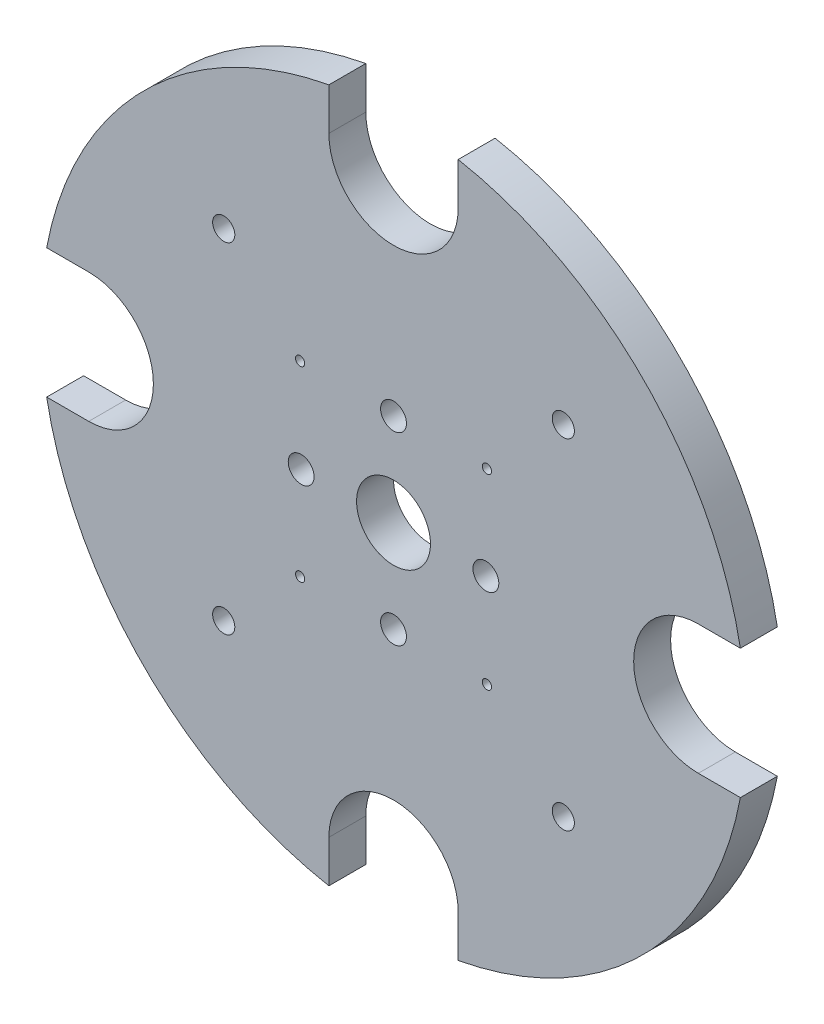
ISO-10303-21;
HEADER;
FILE_DESCRIPTION(('STEP AP214'),'2;1');
FILE_NAME('part.step','',(''),(''),'','','');
FILE_SCHEMA(('AUTOMOTIVE_DESIGN { 1 0 10303 214 1 1 1 1 }'));
ENDSEC;
DATA;
#1=APPLICATION_CONTEXT('core data for automotive mechanical design processes');
#2=APPLICATION_PROTOCOL_DEFINITION('international standard','automotive_design',2000,#1);
#3=PRODUCT_CONTEXT('',#1,'mechanical');
#4=PRODUCT('Part','Part','',(#3));
#5=PRODUCT_RELATED_PRODUCT_CATEGORY('part','',(#4));
#6=PRODUCT_DEFINITION_FORMATION('','',#4);
#7=PRODUCT_DEFINITION_CONTEXT('part definition',#1,'design');
#8=PRODUCT_DEFINITION('design','',#6,#7);
#9=PRODUCT_DEFINITION_SHAPE('','',#8);
#10=(LENGTH_UNIT() NAMED_UNIT(*) SI_UNIT(.MILLI.,.METRE.));
#11=(NAMED_UNIT(*) PLANE_ANGLE_UNIT() SI_UNIT($,.RADIAN.));
#12=(NAMED_UNIT(*) SI_UNIT($,.STERADIAN.) SOLID_ANGLE_UNIT());
#13=UNCERTAINTY_MEASURE_WITH_UNIT(LENGTH_MEASURE(1.E-05),#10,'distance_accuracy_value','');
#14=(GEOMETRIC_REPRESENTATION_CONTEXT(3) GLOBAL_UNCERTAINTY_ASSIGNED_CONTEXT((#13)) GLOBAL_UNIT_ASSIGNED_CONTEXT((#10,
#11,#12)) REPRESENTATION_CONTEXT('',''));
#15=CARTESIAN_POINT('',(0.,0.,0.));
#16=DIRECTION('',(0.,0.,1.));
#17=DIRECTION('',(1.,0.,0.));
#18=AXIS2_PLACEMENT_3D('',#15,#16,#17);
#19=CARTESIAN_POINT('',(0.,0.,20.));
#20=DIRECTION('',(0.,0.,-1.));
#21=DIRECTION('',(-1.,0.,0.));
#22=AXIS2_PLACEMENT_3D('',#19,#20,#21);
#23=CYLINDRICAL_SURFACE('',#22,191.);
#24=CARTESIAN_POINT('',(0.,0.,0.));
#25=DIRECTION('',(0.,0.,1.));
#26=DIRECTION('',(1.,0.,0.));
#27=AXIS2_PLACEMENT_3D('',#24,#25,#26);
#28=CIRCLE('',#27,191.);
#29=CARTESIAN_POINT('',(-35.,187.765811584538,0.));
#30=VERTEX_POINT('',#29);
#31=CARTESIAN_POINT('',(-187.765811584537,35.000000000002,0.));
#32=VERTEX_POINT('',#31);
#33=EDGE_CURVE('E344',#30,#32,#28,.T.);
#34=ORIENTED_EDGE('',*,*,#33,.T.);
#35=DIRECTION('',(0.,0.,1.));
#36=VECTOR('',#35,1.);
#37=CARTESIAN_POINT('',(-187.765811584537,35.000000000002,0.));
#38=LINE('',#37,#36);
#39=CARTESIAN_POINT('',(-187.765811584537,35.000000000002,20.0000000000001));
#40=VERTEX_POINT('',#39);
#41=EDGE_CURVE('E182',#32,#40,#38,.T.);
#42=ORIENTED_EDGE('',*,*,#41,.T.);
#43=CARTESIAN_POINT('',(0.,0.,20.));
#44=DIRECTION('',(0.,0.,1.));
#45=DIRECTION('',(1.,0.,0.));
#46=AXIS2_PLACEMENT_3D('',#43,#44,#45);
#47=CIRCLE('',#46,191.);
#48=CARTESIAN_POINT('',(-35.,187.765811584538,20.));
#49=VERTEX_POINT('',#48);
#50=EDGE_CURVE('E11',#49,#40,#47,.T.);
#51=ORIENTED_EDGE('',*,*,#50,.F.);
#52=DIRECTION('',(0.,0.,1.));
#53=VECTOR('',#52,1.);
#54=CARTESIAN_POINT('',(-35.,187.765811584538,0.));
#55=LINE('',#54,#53);
#56=EDGE_CURVE('E257',#30,#49,#55,.T.);
#57=ORIENTED_EDGE('',*,*,#56,.F.);
#58=EDGE_LOOP('',(#34,#42,#51,#57));
#59=FACE_BOUND('',#58,.T.);
#60=ADVANCED_FACE('F38',(#59),#23,.T.);
#61=CARTESIAN_POINT('',(-187.765811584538,-34.999999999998,20.));
#62=VERTEX_POINT('',#61);
#63=CARTESIAN_POINT('',(-35.0000000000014,-187.765811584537,20.0000000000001));
#64=VERTEX_POINT('',#63);
#65=EDGE_CURVE('E46',#62,#64,#47,.T.);
#66=ORIENTED_EDGE('',*,*,#65,.F.);
#67=DIRECTION('',(0.,0.,1.));
#68=VECTOR('',#67,1.);
#69=CARTESIAN_POINT('',(-187.765811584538,-34.999999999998,0.));
#70=LINE('',#69,#68);
#71=CARTESIAN_POINT('',(-187.765811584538,-34.999999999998,0.));
#72=VERTEX_POINT('',#71);
#73=EDGE_CURVE('E158',#72,#62,#70,.T.);
#74=ORIENTED_EDGE('',*,*,#73,.F.);
#75=CARTESIAN_POINT('',(-35.0000000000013,-187.765811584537,0.));
#76=VERTEX_POINT('',#75);
#77=EDGE_CURVE('E346',#72,#76,#28,.T.);
#78=ORIENTED_EDGE('',*,*,#77,.T.);
#79=DIRECTION('',(0.,0.,1.));
#80=VECTOR('',#79,1.);
#81=CARTESIAN_POINT('',(-35.0000000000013,-187.765811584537,0.));
#82=LINE('',#81,#80);
#83=EDGE_CURVE('E206',#76,#64,#82,.T.);
#84=ORIENTED_EDGE('',*,*,#83,.T.);
#85=EDGE_LOOP('',(#66,#74,#78,#84));
#86=FACE_BOUND('',#85,.T.);
#87=ADVANCED_FACE('F393',(#86),#23,.T.);
#88=CARTESIAN_POINT('',(34.9999999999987,-187.765811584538,20.));
#89=VERTEX_POINT('',#88);
#90=CARTESIAN_POINT('',(187.765811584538,-35.0000000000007,20.));
#91=VERTEX_POINT('',#90);
#92=EDGE_CURVE('E350',#89,#91,#47,.T.);
#93=ORIENTED_EDGE('',*,*,#92,.F.);
#94=DIRECTION('',(0.,0.,1.));
#95=VECTOR('',#94,1.);
#96=CARTESIAN_POINT('',(34.9999999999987,-187.765811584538,0.));
#97=LINE('',#96,#95);
#98=CARTESIAN_POINT('',(34.9999999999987,-187.765811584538,0.));
#99=VERTEX_POINT('',#98);
#100=EDGE_CURVE('E195',#99,#89,#97,.T.);
#101=ORIENTED_EDGE('',*,*,#100,.F.);
#102=CARTESIAN_POINT('',(187.765811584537,-35.0000000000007,0.));
#103=VERTEX_POINT('',#102);
#104=EDGE_CURVE('E351',#99,#103,#28,.T.);
#105=ORIENTED_EDGE('',*,*,#104,.T.);
#106=DIRECTION('',(0.,0.,1.));
#107=VECTOR('',#106,1.);
#108=CARTESIAN_POINT('',(187.765811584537,-35.0000000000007,0.));
#109=LINE('',#108,#107);
#110=EDGE_CURVE('E233',#103,#91,#109,.T.);
#111=ORIENTED_EDGE('',*,*,#110,.T.);
#112=EDGE_LOOP('',(#93,#101,#105,#111));
#113=FACE_BOUND('',#112,.T.);
#114=ADVANCED_FACE('F361',(#113),#23,.T.);
#115=CARTESIAN_POINT('',(187.765811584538,34.9999999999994,20.));
#116=VERTEX_POINT('',#115);
#117=CARTESIAN_POINT('',(35.,187.765811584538,19.9999999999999));
#118=VERTEX_POINT('',#117);
#119=EDGE_CURVE('E47',#116,#118,#47,.T.);
#120=ORIENTED_EDGE('',*,*,#119,.F.);
#121=DIRECTION('',(0.,0.,1.));
#122=VECTOR('',#121,1.);
#123=CARTESIAN_POINT('',(187.765811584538,34.9999999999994,0.));
#124=LINE('',#123,#122);
#125=CARTESIAN_POINT('',(187.765811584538,34.9999999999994,0.));
#126=VERTEX_POINT('',#125);
#127=EDGE_CURVE('E220',#126,#116,#124,.T.);
#128=ORIENTED_EDGE('',*,*,#127,.F.);
#129=CARTESIAN_POINT('',(35.,187.765811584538,0.));
#130=VERTEX_POINT('',#129);
#131=EDGE_CURVE('E343',#126,#130,#28,.T.);
#132=ORIENTED_EDGE('',*,*,#131,.T.);
#133=DIRECTION('',(0.,0.,1.));
#134=VECTOR('',#133,1.);
#135=CARTESIAN_POINT('',(35.,187.765811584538,0.));
#136=LINE('',#135,#134);
#137=EDGE_CURVE('E258',#130,#118,#136,.T.);
#138=ORIENTED_EDGE('',*,*,#137,.T.);
#139=EDGE_LOOP('',(#120,#128,#132,#138));
#140=FACE_BOUND('',#139,.T.);
#141=ADVANCED_FACE('F40',(#140),#23,.T.);
#142=CARTESIAN_POINT('',(0.,0.,20.));
#143=DIRECTION('',(0.,0.,1.));
#144=DIRECTION('',(1.,0.,0.));
#145=AXIS2_PLACEMENT_3D('',#142,#143,#144);
#146=PLANE('',#145);
#147=DIRECTION('',(-1.,0.,0.));
#148=VECTOR('',#147,1.);
#149=CARTESIAN_POINT('',(-165.,35.0000000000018,20.));
#150=LINE('',#149,#148);
#151=CARTESIAN_POINT('',(-165.,35.0000000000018,20.));
#152=VERTEX_POINT('',#151);
#153=EDGE_CURVE('E172',#152,#40,#150,.T.);
#154=ORIENTED_EDGE('',*,*,#153,.F.);
#155=CARTESIAN_POINT('',(-165.,1.74860126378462E-12,20.));
#156=DIRECTION('',(0.,0.,1.));
#157=DIRECTION('',(0.,1.,0.));
#158=AXIS2_PLACEMENT_3D('',#155,#156,#157);
#159=CIRCLE('',#158,35.);
#160=CARTESIAN_POINT('',(-165.,-34.9999999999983,20.));
#161=VERTEX_POINT('',#160);
#162=EDGE_CURVE('E165',#161,#152,#159,.T.);
#163=ORIENTED_EDGE('',*,*,#162,.F.);
#164=DIRECTION('',(1.,0.,0.));
#165=VECTOR('',#164,1.);
#166=CARTESIAN_POINT('',(-187.765811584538,-34.999999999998,20.));
#167=LINE('',#166,#165);
#168=EDGE_CURVE('E153',#62,#161,#167,.T.);
#169=ORIENTED_EDGE('',*,*,#168,.F.);
#170=ORIENTED_EDGE('',*,*,#65,.T.);
#171=DIRECTION('',(0.,-1.,0.));
#172=VECTOR('',#171,1.);
#173=CARTESIAN_POINT('',(-35.0000000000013,-165.,20.));
#174=LINE('',#173,#172);
#175=CARTESIAN_POINT('',(-35.0000000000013,-165.,20.));
#176=VERTEX_POINT('',#175);
#177=EDGE_CURVE('E203',#176,#64,#174,.T.);
#178=ORIENTED_EDGE('',*,*,#177,.F.);
#179=CARTESIAN_POINT('',(-1.16573417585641E-12,-165.,20.));
#180=DIRECTION('',(0.,0.,1.));
#181=DIRECTION('',(-1.,0.,0.));
#182=AXIS2_PLACEMENT_3D('',#179,#180,#181);
#183=CIRCLE('',#182,35.);
#184=CARTESIAN_POINT('',(34.9999999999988,-165.,20.));
#185=VERTEX_POINT('',#184);
#186=EDGE_CURVE('E197',#185,#176,#183,.T.);
#187=ORIENTED_EDGE('',*,*,#186,.F.);
#188=DIRECTION('',(0.,1.,0.));
#189=VECTOR('',#188,1.);
#190=CARTESIAN_POINT('',(34.9999999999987,-187.765811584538,20.));
#191=LINE('',#190,#189);
#192=EDGE_CURVE('E188',#89,#185,#191,.T.);
#193=ORIENTED_EDGE('',*,*,#192,.F.);
#194=ORIENTED_EDGE('',*,*,#92,.T.);
#195=DIRECTION('',(1.,0.,0.));
#196=VECTOR('',#195,1.);
#197=CARTESIAN_POINT('',(165.,-35.0000000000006,20.));
#198=LINE('',#197,#196);
#199=CARTESIAN_POINT('',(165.,-35.0000000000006,20.));
#200=VERTEX_POINT('',#199);
#201=EDGE_CURVE('E230',#200,#91,#198,.T.);
#202=ORIENTED_EDGE('',*,*,#201,.F.);
#203=CARTESIAN_POINT('',(165.,-5.55111512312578E-13,20.));
#204=DIRECTION('',(0.,0.,1.));
#205=DIRECTION('',(0.,-1.,0.));
#206=AXIS2_PLACEMENT_3D('',#203,#204,#205);
#207=CIRCLE('',#206,35.);
#208=CARTESIAN_POINT('',(165.,34.9999999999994,20.));
#209=VERTEX_POINT('',#208);
#210=EDGE_CURVE('E222',#209,#200,#207,.T.);
#211=ORIENTED_EDGE('',*,*,#210,.F.);
#212=DIRECTION('',(-1.,0.,0.));
#213=VECTOR('',#212,1.);
#214=CARTESIAN_POINT('',(187.765811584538,34.9999999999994,20.));
#215=LINE('',#214,#213);
#216=EDGE_CURVE('E212',#116,#209,#215,.T.);
#217=ORIENTED_EDGE('',*,*,#216,.F.);
#218=ORIENTED_EDGE('',*,*,#119,.T.);
#219=DIRECTION('',(0.,1.,0.));
#220=VECTOR('',#219,1.);
#221=CARTESIAN_POINT('',(35.,165.,20.));
#222=LINE('',#221,#220);
#223=CARTESIAN_POINT('',(35.,165.,20.));
#224=VERTEX_POINT('',#223);
#225=EDGE_CURVE('E245',#224,#118,#222,.T.);
#226=ORIENTED_EDGE('',*,*,#225,.F.);
#227=CARTESIAN_POINT('',(0.,165.,20.));
#228=DIRECTION('',(0.,0.,1.));
#229=DIRECTION('',(1.,0.,0.));
#230=AXIS2_PLACEMENT_3D('',#227,#228,#229);
#231=CIRCLE('',#230,35.);
#232=CARTESIAN_POINT('',(-35.,165.,20.));
#233=VERTEX_POINT('',#232);
#234=EDGE_CURVE('E242',#233,#224,#231,.T.);
#235=ORIENTED_EDGE('',*,*,#234,.F.);
#236=DIRECTION('',(0.,-1.,0.));
#237=VECTOR('',#236,1.);
#238=CARTESIAN_POINT('',(-35.,187.765811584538,20.));
#239=LINE('',#238,#237);
#240=EDGE_CURVE('E239',#49,#233,#239,.T.);
#241=ORIENTED_EDGE('',*,*,#240,.F.);
#242=ORIENTED_EDGE('',*,*,#50,.T.);
#243=EDGE_LOOP('',(#154,#163,#169,#170,#178,#187,#193,#194,#202,#211,#217,#218,#226,#235,#241,#242));
#244=FACE_BOUND('',#243,.T.);
#245=CARTESIAN_POINT('',(-91.9238815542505,91.923881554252,20.));
#246=DIRECTION('',(0.,0.,1.));
#247=DIRECTION('',(0.,1.,0.));
#248=AXIS2_PLACEMENT_3D('',#245,#246,#247);
#249=CIRCLE('',#248,6.);
#250=CARTESIAN_POINT('',(-91.9238815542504,97.923881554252,20.));
#251=VERTEX_POINT('',#250);
#252=EDGE_CURVE('E269',#251,#251,#249,.T.);
#253=ORIENTED_EDGE('',*,*,#252,.F.);
#254=EDGE_LOOP('',(#253));
#255=FACE_BOUND('',#254,.T.);
#256=CARTESIAN_POINT('',(-91.9238815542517,-91.9238815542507,20.));
#257=DIRECTION('',(0.,0.,1.));
#258=DIRECTION('',(-1.,0.,0.));
#259=AXIS2_PLACEMENT_3D('',#256,#257,#258);
#260=CIRCLE('',#259,6.);
#261=CARTESIAN_POINT('',(-97.9238815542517,-91.9238815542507,20.));
#262=VERTEX_POINT('',#261);
#263=EDGE_CURVE('E275',#262,#262,#260,.T.);
#264=ORIENTED_EDGE('',*,*,#263,.F.);
#265=EDGE_LOOP('',(#264));
#266=FACE_BOUND('',#265,.T.);
#267=CARTESIAN_POINT('',(91.923881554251,-91.9238815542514,20.));
#268=DIRECTION('',(0.,0.,1.));
#269=DIRECTION('',(0.,-1.,0.));
#270=AXIS2_PLACEMENT_3D('',#267,#268,#269);
#271=CIRCLE('',#270,6.);
#272=CARTESIAN_POINT('',(91.923881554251,-97.9238815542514,20.));
#273=VERTEX_POINT('',#272);
#274=EDGE_CURVE('E281',#273,#273,#271,.T.);
#275=ORIENTED_EDGE('',*,*,#274,.F.);
#276=EDGE_LOOP('',(#275));
#277=FACE_BOUND('',#276,.T.);
#278=CARTESIAN_POINT('',(-50.5581348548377,50.5581348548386,20.));
#279=DIRECTION('',(0.,0.,1.));
#280=DIRECTION('',(0.,1.,0.));
#281=AXIS2_PLACEMENT_3D('',#278,#279,#280);
#282=CIRCLE('',#281,2.5);
#283=CARTESIAN_POINT('',(-50.5581348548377,53.0581348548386,20.));
#284=VERTEX_POINT('',#283);
#285=EDGE_CURVE('E287',#284,#284,#282,.T.);
#286=ORIENTED_EDGE('',*,*,#285,.F.);
#287=EDGE_LOOP('',(#286));
#288=FACE_BOUND('',#287,.T.);
#289=CARTESIAN_POINT('',(-50.5581348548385,-50.5581348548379,20.));
#290=DIRECTION('',(0.,0.,1.));
#291=DIRECTION('',(-1.,0.,0.));
#292=AXIS2_PLACEMENT_3D('',#289,#290,#291);
#293=CIRCLE('',#292,2.5);
#294=CARTESIAN_POINT('',(-53.0581348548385,-50.5581348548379,20.));
#295=VERTEX_POINT('',#294);
#296=EDGE_CURVE('E293',#295,#295,#293,.T.);
#297=ORIENTED_EDGE('',*,*,#296,.F.);
#298=EDGE_LOOP('',(#297));
#299=FACE_BOUND('',#298,.T.);
#300=CARTESIAN_POINT('',(50.5581348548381,-50.5581348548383,20.));
#301=DIRECTION('',(0.,0.,1.));
#302=DIRECTION('',(0.,-1.,0.));
#303=AXIS2_PLACEMENT_3D('',#300,#301,#302);
#304=CIRCLE('',#303,2.5);
#305=CARTESIAN_POINT('',(50.5581348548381,-53.0581348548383,20.));
#306=VERTEX_POINT('',#305);
#307=EDGE_CURVE('E299',#306,#306,#304,.T.);
#308=ORIENTED_EDGE('',*,*,#307,.F.);
#309=EDGE_LOOP('',(#308));
#310=FACE_BOUND('',#309,.T.);
#311=CARTESIAN_POINT('',(50.5581348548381,50.5581348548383,20.));
#312=DIRECTION('',(0.,0.,1.));
#313=DIRECTION('',(1.,0.,0.));
#314=AXIS2_PLACEMENT_3D('',#311,#312,#313);
#315=CIRCLE('',#314,2.5);
#316=CARTESIAN_POINT('',(53.0581348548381,50.5581348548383,20.));
#317=VERTEX_POINT('',#316);
#318=EDGE_CURVE('E302',#317,#317,#315,.T.);
#319=ORIENTED_EDGE('',*,*,#318,.F.);
#320=EDGE_LOOP('',(#319));
#321=FACE_BOUND('',#320,.T.);
#322=CARTESIAN_POINT('',(91.923881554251,91.9238815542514,20.));
#323=DIRECTION('',(0.,0.,1.));
#324=DIRECTION('',(1.,0.,0.));
#325=AXIS2_PLACEMENT_3D('',#322,#323,#324);
#326=CIRCLE('',#325,6.);
#327=CARTESIAN_POINT('',(97.923881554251,91.9238815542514,20.));
#328=VERTEX_POINT('',#327);
#329=EDGE_CURVE('E308',#328,#328,#326,.T.);
#330=ORIENTED_EDGE('',*,*,#329,.F.);
#331=EDGE_LOOP('',(#330));
#332=FACE_BOUND('',#331,.T.);
#333=CARTESIAN_POINT('',(4.9960036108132E-13,50.,20.));
#334=DIRECTION('',(0.,0.,1.));
#335=DIRECTION('',(0.,1.,0.));
#336=AXIS2_PLACEMENT_3D('',#333,#334,#335);
#337=CIRCLE('',#336,7.);
#338=CARTESIAN_POINT('',(5.72921511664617E-13,57.,20.));
#339=VERTEX_POINT('',#338);
#340=EDGE_CURVE('E317',#339,#339,#337,.T.);
#341=ORIENTED_EDGE('',*,*,#340,.F.);
#342=EDGE_LOOP('',(#341));
#343=FACE_BOUND('',#342,.T.);
#344=CARTESIAN_POINT('',(-50.,3.67761376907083E-13,20.));
#345=DIRECTION('',(0.,0.,1.));
#346=DIRECTION('',(-1.,0.,0.));
#347=AXIS2_PLACEMENT_3D('',#344,#345,#346);
#348=CIRCLE('',#347,7.);
#349=CARTESIAN_POINT('',(-57.,4.16642143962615E-13,20.));
#350=VERTEX_POINT('',#349);
#351=EDGE_CURVE('E323',#350,#350,#348,.T.);
#352=ORIENTED_EDGE('',*,*,#351,.F.);
#353=EDGE_LOOP('',(#352));
#354=FACE_BOUND('',#353,.T.);
#355=CARTESIAN_POINT('',(-1.66533453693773E-13,-50.,20.));
#356=DIRECTION('',(0.,0.,1.));
#357=DIRECTION('',(0.,-1.,0.));
#358=AXIS2_PLACEMENT_3D('',#355,#356,#357);
#359=CIRCLE('',#358,7.);
#360=CARTESIAN_POINT('',(-1.90973837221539E-13,-57.,20.));
#361=VERTEX_POINT('',#360);
#362=EDGE_CURVE('E329',#361,#361,#359,.T.);
#363=ORIENTED_EDGE('',*,*,#362,.F.);
#364=EDGE_LOOP('',(#363));
#365=FACE_BOUND('',#364,.T.);
#366=CARTESIAN_POINT('',(50.,0.,20.));
#367=DIRECTION('',(0.,0.,1.));
#368=DIRECTION('',(1.,0.,0.));
#369=AXIS2_PLACEMENT_3D('',#366,#367,#368);
#370=CIRCLE('',#369,7.);
#371=CARTESIAN_POINT('',(57.,0.,20.));
#372=VERTEX_POINT('',#371);
#373=EDGE_CURVE('E332',#372,#372,#370,.T.);
#374=ORIENTED_EDGE('',*,*,#373,.F.);
#375=EDGE_LOOP('',(#374));
#376=FACE_BOUND('',#375,.T.);
#377=CARTESIAN_POINT('',(0.,0.,20.));
#378=DIRECTION('',(0.,0.,1.));
#379=DIRECTION('',(1.,0.,0.));
#380=AXIS2_PLACEMENT_3D('',#377,#378,#379);
#381=CIRCLE('',#380,20.);
#382=CARTESIAN_POINT('',(20.,0.,20.));
#383=VERTEX_POINT('',#382);
#384=EDGE_CURVE('E338',#383,#383,#381,.T.);
#385=ORIENTED_EDGE('',*,*,#384,.F.);
#386=EDGE_LOOP('',(#385));
#387=FACE_BOUND('',#386,.T.);
#388=ADVANCED_FACE('F170',(#244,#255,#266,#277,#288,#299,#310,#321,#332,#343,#354,#365,#376,
#387),#146,.T.);
#389=CARTESIAN_POINT('',(0.,0.,0.));
#390=DIRECTION('',(0.,0.,1.));
#391=DIRECTION('',(1.,0.,0.));
#392=AXIS2_PLACEMENT_3D('',#389,#390,#391);
#393=PLANE('',#392);
#394=CARTESIAN_POINT('',(-91.9238815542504,91.923881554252,0.));
#395=DIRECTION('',(0.,0.,1.));
#396=DIRECTION('',(0.,1.,0.));
#397=AXIS2_PLACEMENT_3D('',#394,#395,#396);
#398=CIRCLE('',#397,6.);
#399=CARTESIAN_POINT('',(-91.9238815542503,97.923881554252,0.));
#400=VERTEX_POINT('',#399);
#401=EDGE_CURVE('E261',#400,#400,#398,.T.);
#402=ORIENTED_EDGE('',*,*,#401,.T.);
#403=EDGE_LOOP('',(#402));
#404=FACE_BOUND('',#403,.T.);
#405=CARTESIAN_POINT('',(-91.9238815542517,-91.9238815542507,0.));
#406=DIRECTION('',(0.,0.,1.));
#407=DIRECTION('',(-1.,0.,0.));
#408=AXIS2_PLACEMENT_3D('',#405,#406,#407);
#409=CIRCLE('',#408,6.);
#410=CARTESIAN_POINT('',(-97.9238815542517,-91.9238815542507,0.));
#411=VERTEX_POINT('',#410);
#412=EDGE_CURVE('E272',#411,#411,#409,.T.);
#413=ORIENTED_EDGE('',*,*,#412,.T.);
#414=EDGE_LOOP('',(#413));
#415=FACE_BOUND('',#414,.T.);
#416=CARTESIAN_POINT('',(91.923881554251,-91.9238815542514,0.));
#417=DIRECTION('',(0.,0.,1.));
#418=DIRECTION('',(0.,-1.,0.));
#419=AXIS2_PLACEMENT_3D('',#416,#417,#418);
#420=CIRCLE('',#419,6.);
#421=CARTESIAN_POINT('',(91.923881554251,-97.9238815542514,0.));
#422=VERTEX_POINT('',#421);
#423=EDGE_CURVE('E278',#422,#422,#420,.T.);
#424=ORIENTED_EDGE('',*,*,#423,.T.);
#425=EDGE_LOOP('',(#424));
#426=FACE_BOUND('',#425,.T.);
#427=CARTESIAN_POINT('',(-50.5581348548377,50.5581348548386,0.));
#428=DIRECTION('',(0.,0.,1.));
#429=DIRECTION('',(0.,1.,0.));
#430=AXIS2_PLACEMENT_3D('',#427,#428,#429);
#431=CIRCLE('',#430,2.5);
#432=CARTESIAN_POINT('',(-50.5581348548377,53.0581348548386,0.));
#433=VERTEX_POINT('',#432);
#434=EDGE_CURVE('E284',#433,#433,#431,.T.);
#435=ORIENTED_EDGE('',*,*,#434,.T.);
#436=EDGE_LOOP('',(#435));
#437=FACE_BOUND('',#436,.T.);
#438=CARTESIAN_POINT('',(-50.5581348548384,-50.5581348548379,0.));
#439=DIRECTION('',(0.,0.,1.));
#440=DIRECTION('',(-1.,0.,0.));
#441=AXIS2_PLACEMENT_3D('',#438,#439,#440);
#442=CIRCLE('',#441,2.5);
#443=CARTESIAN_POINT('',(-53.0581348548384,-50.5581348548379,0.));
#444=VERTEX_POINT('',#443);
#445=EDGE_CURVE('E290',#444,#444,#442,.T.);
#446=ORIENTED_EDGE('',*,*,#445,.T.);
#447=EDGE_LOOP('',(#446));
#448=FACE_BOUND('',#447,.T.);
#449=CARTESIAN_POINT('',(50.5581348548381,-50.5581348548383,0.));
#450=DIRECTION('',(0.,0.,1.));
#451=DIRECTION('',(0.,-1.,0.));
#452=AXIS2_PLACEMENT_3D('',#449,#450,#451);
#453=CIRCLE('',#452,2.5);
#454=CARTESIAN_POINT('',(50.5581348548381,-53.0581348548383,0.));
#455=VERTEX_POINT('',#454);
#456=EDGE_CURVE('E296',#455,#455,#453,.T.);
#457=ORIENTED_EDGE('',*,*,#456,.T.);
#458=EDGE_LOOP('',(#457));
#459=FACE_BOUND('',#458,.T.);
#460=CARTESIAN_POINT('',(50.5581348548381,50.5581348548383,0.));
#461=DIRECTION('',(0.,0.,1.));
#462=DIRECTION('',(1.,0.,0.));
#463=AXIS2_PLACEMENT_3D('',#460,#461,#462);
#464=CIRCLE('',#463,2.5);
#465=CARTESIAN_POINT('',(53.0581348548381,50.5581348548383,0.));
#466=VERTEX_POINT('',#465);
#467=EDGE_CURVE('E305',#466,#466,#464,.T.);
#468=ORIENTED_EDGE('',*,*,#467,.T.);
#469=EDGE_LOOP('',(#468));
#470=FACE_BOUND('',#469,.T.);
#471=CARTESIAN_POINT('',(91.923881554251,91.9238815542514,0.));
#472=DIRECTION('',(0.,0.,1.));
#473=DIRECTION('',(1.,0.,0.));
#474=AXIS2_PLACEMENT_3D('',#471,#472,#473);
#475=CIRCLE('',#474,6.);
#476=CARTESIAN_POINT('',(97.923881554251,91.9238815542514,0.));
#477=VERTEX_POINT('',#476);
#478=EDGE_CURVE('E311',#477,#477,#475,.T.);
#479=ORIENTED_EDGE('',*,*,#478,.T.);
#480=EDGE_LOOP('',(#479));
#481=FACE_BOUND('',#480,.T.);
#482=CARTESIAN_POINT('',(4.9960036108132E-13,50.,0.));
#483=DIRECTION('',(0.,0.,1.));
#484=DIRECTION('',(0.,1.,0.));
#485=AXIS2_PLACEMENT_3D('',#482,#483,#484);
#486=CIRCLE('',#485,7.);
#487=CARTESIAN_POINT('',(5.72921511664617E-13,57.,0.));
#488=VERTEX_POINT('',#487);
#489=EDGE_CURVE('E314',#488,#488,#486,.T.);
#490=ORIENTED_EDGE('',*,*,#489,.T.);
#491=EDGE_LOOP('',(#490));
#492=FACE_BOUND('',#491,.T.);
#493=CARTESIAN_POINT('',(-50.,3.53883589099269E-13,0.));
#494=DIRECTION('',(0.,0.,1.));
#495=DIRECTION('',(-1.,0.,0.));
#496=AXIS2_PLACEMENT_3D('',#493,#494,#495);
#497=CIRCLE('',#496,7.);
#498=CARTESIAN_POINT('',(-57.,4.027643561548E-13,0.));
#499=VERTEX_POINT('',#498);
#500=EDGE_CURVE('E320',#499,#499,#497,.T.);
#501=ORIENTED_EDGE('',*,*,#500,.T.);
#502=EDGE_LOOP('',(#501));
#503=FACE_BOUND('',#502,.T.);
#504=CARTESIAN_POINT('',(-1.66533453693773E-13,-50.,0.));
#505=DIRECTION('',(0.,0.,1.));
#506=DIRECTION('',(0.,-1.,0.));
#507=AXIS2_PLACEMENT_3D('',#504,#505,#506);
#508=CIRCLE('',#507,7.);
#509=CARTESIAN_POINT('',(-1.90973837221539E-13,-57.,0.));
#510=VERTEX_POINT('',#509);
#511=EDGE_CURVE('E326',#510,#510,#508,.T.);
#512=ORIENTED_EDGE('',*,*,#511,.T.);
#513=EDGE_LOOP('',(#512));
#514=FACE_BOUND('',#513,.T.);
#515=CARTESIAN_POINT('',(50.,0.,0.));
#516=DIRECTION('',(0.,0.,1.));
#517=DIRECTION('',(1.,0.,0.));
#518=AXIS2_PLACEMENT_3D('',#515,#516,#517);
#519=CIRCLE('',#518,7.);
#520=CARTESIAN_POINT('',(57.,0.,0.));
#521=VERTEX_POINT('',#520);
#522=EDGE_CURVE('E335',#521,#521,#519,.T.);
#523=ORIENTED_EDGE('',*,*,#522,.T.);
#524=EDGE_LOOP('',(#523));
#525=FACE_BOUND('',#524,.T.);
#526=CARTESIAN_POINT('',(0.,0.,0.));
#527=DIRECTION('',(0.,0.,1.));
#528=DIRECTION('',(1.,0.,0.));
#529=AXIS2_PLACEMENT_3D('',#526,#527,#528);
#530=CIRCLE('',#529,20.);
#531=CARTESIAN_POINT('',(20.,0.,0.));
#532=VERTEX_POINT('',#531);
#533=EDGE_CURVE('E341',#532,#532,#530,.T.);
#534=ORIENTED_EDGE('',*,*,#533,.T.);
#535=EDGE_LOOP('',(#534));
#536=FACE_BOUND('',#535,.T.);
#537=CARTESIAN_POINT('',(-165.,1.74860126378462E-12,0.));
#538=DIRECTION('',(0.,0.,1.));
#539=DIRECTION('',(0.,1.,0.));
#540=AXIS2_PLACEMENT_3D('',#537,#538,#539);
#541=CIRCLE('',#540,35.);
#542=CARTESIAN_POINT('',(-165.,-34.9999999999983,0.));
#543=VERTEX_POINT('',#542);
#544=CARTESIAN_POINT('',(-165.,35.0000000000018,0.));
#545=VERTEX_POINT('',#544);
#546=EDGE_CURVE('E54',#543,#545,#541,.T.);
#547=ORIENTED_EDGE('',*,*,#546,.T.);
#548=DIRECTION('',(-1.,0.,0.));
#549=VECTOR('',#548,1.);
#550=CARTESIAN_POINT('',(-165.,35.0000000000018,0.));
#551=LINE('',#550,#549);
#552=EDGE_CURVE('E185',#545,#32,#551,.T.);
#553=ORIENTED_EDGE('',*,*,#552,.T.);
#554=ORIENTED_EDGE('',*,*,#33,.F.);
#555=DIRECTION('',(0.,-1.,0.));
#556=VECTOR('',#555,1.);
#557=CARTESIAN_POINT('',(-35.,187.765811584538,0.));
#558=LINE('',#557,#556);
#559=CARTESIAN_POINT('',(-35.,165.,0.));
#560=VERTEX_POINT('',#559);
#561=EDGE_CURVE('E248',#30,#560,#558,.T.);
#562=ORIENTED_EDGE('',*,*,#561,.T.);
#563=CARTESIAN_POINT('',(0.,165.,0.));
#564=DIRECTION('',(0.,0.,1.));
#565=DIRECTION('',(1.,0.,0.));
#566=AXIS2_PLACEMENT_3D('',#563,#564,#565);
#567=CIRCLE('',#566,35.);
#568=CARTESIAN_POINT('',(35.,165.,0.));
#569=VERTEX_POINT('',#568);
#570=EDGE_CURVE('E251',#560,#569,#567,.T.);
#571=ORIENTED_EDGE('',*,*,#570,.T.);
#572=DIRECTION('',(0.,1.,0.));
#573=VECTOR('',#572,1.);
#574=CARTESIAN_POINT('',(35.,165.,0.));
#575=LINE('',#574,#573);
#576=EDGE_CURVE('E254',#569,#130,#575,.T.);
#577=ORIENTED_EDGE('',*,*,#576,.T.);
#578=ORIENTED_EDGE('',*,*,#131,.F.);
#579=DIRECTION('',(-1.,0.,0.));
#580=VECTOR('',#579,1.);
#581=CARTESIAN_POINT('',(187.765811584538,34.9999999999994,0.));
#582=LINE('',#581,#580);
#583=CARTESIAN_POINT('',(165.,34.9999999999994,0.));
#584=VERTEX_POINT('',#583);
#585=EDGE_CURVE('E217',#126,#584,#582,.T.);
#586=ORIENTED_EDGE('',*,*,#585,.T.);
#587=CARTESIAN_POINT('',(165.,-5.759281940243E-13,0.));
#588=DIRECTION('',(0.,0.,1.));
#589=DIRECTION('',(0.,-1.,0.));
#590=AXIS2_PLACEMENT_3D('',#587,#588,#589);
#591=CIRCLE('',#590,35.);
#592=CARTESIAN_POINT('',(165.,-35.0000000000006,0.));
#593=VERTEX_POINT('',#592);
#594=EDGE_CURVE('E227',#584,#593,#591,.T.);
#595=ORIENTED_EDGE('',*,*,#594,.T.);
#596=DIRECTION('',(1.,0.,0.));
#597=VECTOR('',#596,1.);
#598=CARTESIAN_POINT('',(165.,-35.0000000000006,0.));
#599=LINE('',#598,#597);
#600=EDGE_CURVE('E236',#593,#103,#599,.T.);
#601=ORIENTED_EDGE('',*,*,#600,.T.);
#602=ORIENTED_EDGE('',*,*,#104,.F.);
#603=DIRECTION('',(0.,1.,0.));
#604=VECTOR('',#603,1.);
#605=CARTESIAN_POINT('',(34.9999999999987,-187.765811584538,0.));
#606=LINE('',#605,#604);
#607=CARTESIAN_POINT('',(34.9999999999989,-165.,0.));
#608=VERTEX_POINT('',#607);
#609=EDGE_CURVE('E192',#99,#608,#606,.T.);
#610=ORIENTED_EDGE('',*,*,#609,.T.);
#611=CARTESIAN_POINT('',(-1.16573417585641E-12,-165.,0.));
#612=DIRECTION('',(0.,0.,1.));
#613=DIRECTION('',(-1.,0.,0.));
#614=AXIS2_PLACEMENT_3D('',#611,#612,#613);
#615=CIRCLE('',#614,35.);
#616=CARTESIAN_POINT('',(-35.0000000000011,-165.,0.));
#617=VERTEX_POINT('',#616);
#618=EDGE_CURVE('E62',#608,#617,#615,.T.);
#619=ORIENTED_EDGE('',*,*,#618,.T.);
#620=DIRECTION('',(0.,-1.,0.));
#621=VECTOR('',#620,1.);
#622=CARTESIAN_POINT('',(-35.0000000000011,-165.,0.));
#623=LINE('',#622,#621);
#624=EDGE_CURVE('E209',#617,#76,#623,.T.);
#625=ORIENTED_EDGE('',*,*,#624,.T.);
#626=ORIENTED_EDGE('',*,*,#77,.F.);
#627=DIRECTION('',(1.,0.,0.));
#628=VECTOR('',#627,1.);
#629=CARTESIAN_POINT('',(-187.765811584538,-34.999999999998,0.));
#630=LINE('',#629,#628);
#631=EDGE_CURVE('E167',#72,#543,#630,.T.);
#632=ORIENTED_EDGE('',*,*,#631,.T.);
#633=EDGE_LOOP('',(#547,#553,#554,#562,#571,#577,#578,#586,#595,#601,#602,#610,#619,#625,#626,#632));
#634=FACE_BOUND('',#633,.T.);
#635=ADVANCED_FACE('F367',(#404,#415,#426,#437,#448,#459,#470,#481,#492,#503,#514,#525,#536,
#634),#393,.F.);
#636=CARTESIAN_POINT('',(0.,0.,0.));
#637=DIRECTION('',(0.,0.,1.));
#638=DIRECTION('',(1.,0.,0.));
#639=AXIS2_PLACEMENT_3D('',#636,#637,#638);
#640=CYLINDRICAL_SURFACE('',#639,20.);
#641=ORIENTED_EDGE('',*,*,#533,.F.);
#642=EDGE_LOOP('',(#641));
#643=FACE_BOUND('',#642,.T.);
#644=ORIENTED_EDGE('',*,*,#384,.T.);
#645=EDGE_LOOP('',(#644));
#646=FACE_BOUND('',#645,.T.);
#647=ADVANCED_FACE('F459',(#643,#646),#640,.F.);
#648=CARTESIAN_POINT('',(50.,0.,0.));
#649=DIRECTION('',(0.,0.,1.));
#650=DIRECTION('',(1.,0.,0.));
#651=AXIS2_PLACEMENT_3D('',#648,#649,#650);
#652=CYLINDRICAL_SURFACE('',#651,7.);
#653=ORIENTED_EDGE('',*,*,#522,.F.);
#654=EDGE_LOOP('',(#653));
#655=FACE_BOUND('',#654,.T.);
#656=ORIENTED_EDGE('',*,*,#373,.T.);
#657=EDGE_LOOP('',(#656));
#658=FACE_BOUND('',#657,.T.);
#659=ADVANCED_FACE('F470',(#655,#658),#652,.F.);
#660=CARTESIAN_POINT('',(-1.66533453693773E-13,-50.,0.));
#661=DIRECTION('',(0.,0.,1.));
#662=DIRECTION('',(0.,-1.,0.));
#663=AXIS2_PLACEMENT_3D('',#660,#661,#662);
#664=CYLINDRICAL_SURFACE('',#663,7.);
#665=ORIENTED_EDGE('',*,*,#511,.F.);
#666=EDGE_LOOP('',(#665));
#667=FACE_BOUND('',#666,.T.);
#668=ORIENTED_EDGE('',*,*,#362,.T.);
#669=EDGE_LOOP('',(#668));
#670=FACE_BOUND('',#669,.T.);
#671=ADVANCED_FACE('F482',(#667,#670),#664,.F.);
#672=CARTESIAN_POINT('',(-50.,3.53883589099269E-13,0.));
#673=DIRECTION('',(0.,0.,1.));
#674=DIRECTION('',(-1.,0.,0.));
#675=AXIS2_PLACEMENT_3D('',#672,#673,#674);
#676=CYLINDRICAL_SURFACE('',#675,7.);
#677=ORIENTED_EDGE('',*,*,#500,.F.);
#678=EDGE_LOOP('',(#677));
#679=FACE_BOUND('',#678,.T.);
#680=ORIENTED_EDGE('',*,*,#351,.T.);
#681=EDGE_LOOP('',(#680));
#682=FACE_BOUND('',#681,.T.);
#683=ADVANCED_FACE('F494',(#679,#682),#676,.F.);
#684=CARTESIAN_POINT('',(4.9960036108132E-13,50.,0.));
#685=DIRECTION('',(0.,0.,1.));
#686=DIRECTION('',(0.,1.,0.));
#687=AXIS2_PLACEMENT_3D('',#684,#685,#686);
#688=CYLINDRICAL_SURFACE('',#687,7.);
#689=ORIENTED_EDGE('',*,*,#489,.F.);
#690=EDGE_LOOP('',(#689));
#691=FACE_BOUND('',#690,.T.);
#692=ORIENTED_EDGE('',*,*,#340,.T.);
#693=EDGE_LOOP('',(#692));
#694=FACE_BOUND('',#693,.T.);
#695=ADVANCED_FACE('F506',(#691,#694),#688,.F.);
#696=CARTESIAN_POINT('',(91.923881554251,91.9238815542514,0.));
#697=DIRECTION('',(0.,0.,1.));
#698=DIRECTION('',(1.,0.,0.));
#699=AXIS2_PLACEMENT_3D('',#696,#697,#698);
#700=CYLINDRICAL_SURFACE('',#699,6.);
#701=ORIENTED_EDGE('',*,*,#478,.F.);
#702=EDGE_LOOP('',(#701));
#703=FACE_BOUND('',#702,.T.);
#704=ORIENTED_EDGE('',*,*,#329,.T.);
#705=EDGE_LOOP('',(#704));
#706=FACE_BOUND('',#705,.T.);
#707=ADVANCED_FACE('F516',(#703,#706),#700,.F.);
#708=CARTESIAN_POINT('',(50.5581348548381,50.5581348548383,0.));
#709=DIRECTION('',(0.,0.,1.));
#710=DIRECTION('',(1.,0.,0.));
#711=AXIS2_PLACEMENT_3D('',#708,#709,#710);
#712=CYLINDRICAL_SURFACE('',#711,2.5);
#713=ORIENTED_EDGE('',*,*,#467,.F.);
#714=EDGE_LOOP('',(#713));
#715=FACE_BOUND('',#714,.T.);
#716=ORIENTED_EDGE('',*,*,#318,.T.);
#717=EDGE_LOOP('',(#716));
#718=FACE_BOUND('',#717,.T.);
#719=ADVANCED_FACE('F526',(#715,#718),#712,.F.);
#720=CARTESIAN_POINT('',(50.5581348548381,-50.5581348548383,0.));
#721=DIRECTION('',(0.,0.,1.));
#722=DIRECTION('',(0.,-1.,0.));
#723=AXIS2_PLACEMENT_3D('',#720,#721,#722);
#724=CYLINDRICAL_SURFACE('',#723,2.5);
#725=ORIENTED_EDGE('',*,*,#456,.F.);
#726=EDGE_LOOP('',(#725));
#727=FACE_BOUND('',#726,.T.);
#728=ORIENTED_EDGE('',*,*,#307,.T.);
#729=EDGE_LOOP('',(#728));
#730=FACE_BOUND('',#729,.T.);
#731=ADVANCED_FACE('F536',(#727,#730),#724,.F.);
#732=CARTESIAN_POINT('',(-50.5581348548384,-50.5581348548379,0.));
#733=DIRECTION('',(0.,0.,1.));
#734=DIRECTION('',(-1.,0.,0.));
#735=AXIS2_PLACEMENT_3D('',#732,#733,#734);
#736=CYLINDRICAL_SURFACE('',#735,2.5);
#737=ORIENTED_EDGE('',*,*,#445,.F.);
#738=EDGE_LOOP('',(#737));
#739=FACE_BOUND('',#738,.T.);
#740=ORIENTED_EDGE('',*,*,#296,.T.);
#741=EDGE_LOOP('',(#740));
#742=FACE_BOUND('',#741,.T.);
#743=ADVANCED_FACE('F546',(#739,#742),#736,.F.);
#744=CARTESIAN_POINT('',(-50.5581348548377,50.5581348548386,0.));
#745=DIRECTION('',(0.,0.,1.));
#746=DIRECTION('',(0.,1.,0.));
#747=AXIS2_PLACEMENT_3D('',#744,#745,#746);
#748=CYLINDRICAL_SURFACE('',#747,2.5);
#749=ORIENTED_EDGE('',*,*,#434,.F.);
#750=EDGE_LOOP('',(#749));
#751=FACE_BOUND('',#750,.T.);
#752=ORIENTED_EDGE('',*,*,#285,.T.);
#753=EDGE_LOOP('',(#752));
#754=FACE_BOUND('',#753,.T.);
#755=ADVANCED_FACE('F556',(#751,#754),#748,.F.);
#756=CARTESIAN_POINT('',(91.923881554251,-91.9238815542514,0.));
#757=DIRECTION('',(0.,0.,1.));
#758=DIRECTION('',(0.,-1.,0.));
#759=AXIS2_PLACEMENT_3D('',#756,#757,#758);
#760=CYLINDRICAL_SURFACE('',#759,6.);
#761=ORIENTED_EDGE('',*,*,#423,.F.);
#762=EDGE_LOOP('',(#761));
#763=FACE_BOUND('',#762,.T.);
#764=ORIENTED_EDGE('',*,*,#274,.T.);
#765=EDGE_LOOP('',(#764));
#766=FACE_BOUND('',#765,.T.);
#767=ADVANCED_FACE('F566',(#763,#766),#760,.F.);
#768=CARTESIAN_POINT('',(-91.9238815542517,-91.9238815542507,0.));
#769=DIRECTION('',(0.,0.,1.));
#770=DIRECTION('',(-1.,0.,0.));
#771=AXIS2_PLACEMENT_3D('',#768,#769,#770);
#772=CYLINDRICAL_SURFACE('',#771,6.);
#773=ORIENTED_EDGE('',*,*,#412,.F.);
#774=EDGE_LOOP('',(#773));
#775=FACE_BOUND('',#774,.T.);
#776=ORIENTED_EDGE('',*,*,#263,.T.);
#777=EDGE_LOOP('',(#776));
#778=FACE_BOUND('',#777,.T.);
#779=ADVANCED_FACE('F576',(#775,#778),#772,.F.);
#780=CARTESIAN_POINT('',(-91.9238815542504,91.923881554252,0.));
#781=DIRECTION('',(0.,0.,1.));
#782=DIRECTION('',(0.,1.,0.));
#783=AXIS2_PLACEMENT_3D('',#780,#781,#782);
#784=CYLINDRICAL_SURFACE('',#783,6.);
#785=ORIENTED_EDGE('',*,*,#401,.F.);
#786=EDGE_LOOP('',(#785));
#787=FACE_BOUND('',#786,.T.);
#788=ORIENTED_EDGE('',*,*,#252,.T.);
#789=EDGE_LOOP('',(#788));
#790=FACE_BOUND('',#789,.T.);
#791=ADVANCED_FACE('F586',(#787,#790),#784,.F.);
#792=CARTESIAN_POINT('',(35.,165.,0.));
#793=DIRECTION('',(1.,0.,0.));
#794=DIRECTION('',(0.,0.,-1.));
#795=AXIS2_PLACEMENT_3D('',#792,#793,#794);
#796=PLANE('',#795);
#797=ORIENTED_EDGE('',*,*,#225,.T.);
#798=ORIENTED_EDGE('',*,*,#137,.F.);
#799=ORIENTED_EDGE('',*,*,#576,.F.);
#800=DIRECTION('',(0.,0.,1.));
#801=VECTOR('',#800,1.);
#802=CARTESIAN_POINT('',(35.,165.,0.));
#803=LINE('',#802,#801);
#804=EDGE_CURVE('E262',#569,#224,#803,.T.);
#805=ORIENTED_EDGE('',*,*,#804,.T.);
#806=EDGE_LOOP('',(#797,#798,#799,#805));
#807=FACE_BOUND('',#806,.T.);
#808=ADVANCED_FACE('F379',(#807),#796,.F.);
#809=CARTESIAN_POINT('',(0.,165.,0.));
#810=DIRECTION('',(0.,0.,1.));
#811=DIRECTION('',(1.,0.,0.));
#812=AXIS2_PLACEMENT_3D('',#809,#810,#811);
#813=CYLINDRICAL_SURFACE('',#812,35.);
#814=ORIENTED_EDGE('',*,*,#234,.T.);
#815=ORIENTED_EDGE('',*,*,#804,.F.);
#816=ORIENTED_EDGE('',*,*,#570,.F.);
#817=DIRECTION('',(0.,0.,1.));
#818=VECTOR('',#817,1.);
#819=CARTESIAN_POINT('',(-35.,165.,0.));
#820=LINE('',#819,#818);
#821=EDGE_CURVE('E264',#560,#233,#820,.T.);
#822=ORIENTED_EDGE('',*,*,#821,.T.);
#823=EDGE_LOOP('',(#814,#815,#816,#822));
#824=FACE_BOUND('',#823,.T.);
#825=ADVANCED_FACE('F382',(#824),#813,.F.);
#826=CARTESIAN_POINT('',(-35.,187.765811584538,0.));
#827=DIRECTION('',(-1.,0.,0.));
#828=DIRECTION('',(0.,0.,1.));
#829=AXIS2_PLACEMENT_3D('',#826,#827,#828);
#830=PLANE('',#829);
#831=ORIENTED_EDGE('',*,*,#240,.T.);
#832=ORIENTED_EDGE('',*,*,#821,.F.);
#833=ORIENTED_EDGE('',*,*,#561,.F.);
#834=ORIENTED_EDGE('',*,*,#56,.T.);
#835=EDGE_LOOP('',(#831,#832,#833,#834));
#836=FACE_BOUND('',#835,.T.);
#837=ADVANCED_FACE('F384',(#836),#830,.F.);
#838=CARTESIAN_POINT('',(165.,-35.0000000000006,0.));
#839=DIRECTION('',(0.,-1.,0.));
#840=DIRECTION('',(0.,0.,-1.));
#841=AXIS2_PLACEMENT_3D('',#838,#839,#840);
#842=PLANE('',#841);
#843=ORIENTED_EDGE('',*,*,#201,.T.);
#844=ORIENTED_EDGE('',*,*,#110,.F.);
#845=ORIENTED_EDGE('',*,*,#600,.F.);
#846=DIRECTION('',(0.,0.,1.));
#847=VECTOR('',#846,1.);
#848=CARTESIAN_POINT('',(165.,-35.0000000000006,0.));
#849=LINE('',#848,#847);
#850=EDGE_CURVE('E224',#593,#200,#849,.T.);
#851=ORIENTED_EDGE('',*,*,#850,.T.);
#852=EDGE_LOOP('',(#843,#844,#845,#851));
#853=FACE_BOUND('',#852,.T.);
#854=ADVANCED_FACE('F365',(#853),#842,.F.);
#855=CARTESIAN_POINT('',(165.,-5.759281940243E-13,0.));
#856=DIRECTION('',(0.,0.,1.));
#857=DIRECTION('',(0.,-1.,0.));
#858=AXIS2_PLACEMENT_3D('',#855,#856,#857);
#859=CYLINDRICAL_SURFACE('',#858,35.);
#860=ORIENTED_EDGE('',*,*,#210,.T.);
#861=ORIENTED_EDGE('',*,*,#850,.F.);
#862=ORIENTED_EDGE('',*,*,#594,.F.);
#863=DIRECTION('',(0.,0.,1.));
#864=VECTOR('',#863,1.);
#865=CARTESIAN_POINT('',(165.,34.9999999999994,0.));
#866=LINE('',#865,#864);
#867=EDGE_CURVE('E214',#584,#209,#866,.T.);
#868=ORIENTED_EDGE('',*,*,#867,.T.);
#869=EDGE_LOOP('',(#860,#861,#862,#868));
#870=FACE_BOUND('',#869,.T.);
#871=ADVANCED_FACE('F370',(#870),#859,.F.);
#872=CARTESIAN_POINT('',(187.765811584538,34.9999999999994,0.));
#873=DIRECTION('',(0.,1.,0.));
#874=DIRECTION('',(0.,0.,1.));
#875=AXIS2_PLACEMENT_3D('',#872,#873,#874);
#876=PLANE('',#875);
#877=ORIENTED_EDGE('',*,*,#216,.T.);
#878=ORIENTED_EDGE('',*,*,#867,.F.);
#879=ORIENTED_EDGE('',*,*,#585,.F.);
#880=ORIENTED_EDGE('',*,*,#127,.T.);
#881=EDGE_LOOP('',(#877,#878,#879,#880));
#882=FACE_BOUND('',#881,.T.);
#883=ADVANCED_FACE('F373',(#882),#876,.F.);
#884=CARTESIAN_POINT('',(-35.0000000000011,-165.,0.));
#885=DIRECTION('',(-1.,0.,0.));
#886=DIRECTION('',(0.,0.,-1.));
#887=AXIS2_PLACEMENT_3D('',#884,#885,#886);
#888=PLANE('',#887);
#889=ORIENTED_EDGE('',*,*,#177,.T.);
#890=ORIENTED_EDGE('',*,*,#83,.F.);
#891=ORIENTED_EDGE('',*,*,#624,.F.);
#892=DIRECTION('',(0.,0.,1.));
#893=VECTOR('',#892,1.);
#894=CARTESIAN_POINT('',(-35.0000000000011,-165.,0.));
#895=LINE('',#894,#893);
#896=EDGE_CURVE('E199',#617,#176,#895,.T.);
#897=ORIENTED_EDGE('',*,*,#896,.T.);
#898=EDGE_LOOP('',(#889,#890,#891,#897));
#899=FACE_BOUND('',#898,.T.);
#900=ADVANCED_FACE('F403',(#899),#888,.F.);
#901=CARTESIAN_POINT('',(-1.16573417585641E-12,-165.,0.));
#902=DIRECTION('',(0.,0.,1.));
#903=DIRECTION('',(-1.,0.,0.));
#904=AXIS2_PLACEMENT_3D('',#901,#902,#903);
#905=CYLINDRICAL_SURFACE('',#904,35.);
#906=ORIENTED_EDGE('',*,*,#186,.T.);
#907=ORIENTED_EDGE('',*,*,#896,.F.);
#908=ORIENTED_EDGE('',*,*,#618,.F.);
#909=DIRECTION('',(0.,0.,1.));
#910=VECTOR('',#909,1.);
#911=CARTESIAN_POINT('',(34.9999999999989,-165.,0.));
#912=LINE('',#911,#910);
#913=EDGE_CURVE('E190',#608,#185,#912,.T.);
#914=ORIENTED_EDGE('',*,*,#913,.T.);
#915=EDGE_LOOP('',(#906,#907,#908,#914));
#916=FACE_BOUND('',#915,.T.);
#917=ADVANCED_FACE('F400',(#916),#905,.F.);
#918=CARTESIAN_POINT('',(34.9999999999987,-187.765811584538,0.));
#919=DIRECTION('',(1.,0.,0.));
#920=DIRECTION('',(0.,0.,1.));
#921=AXIS2_PLACEMENT_3D('',#918,#919,#920);
#922=PLANE('',#921);
#923=ORIENTED_EDGE('',*,*,#192,.T.);
#924=ORIENTED_EDGE('',*,*,#913,.F.);
#925=ORIENTED_EDGE('',*,*,#609,.F.);
#926=ORIENTED_EDGE('',*,*,#100,.T.);
#927=EDGE_LOOP('',(#923,#924,#925,#926));
#928=FACE_BOUND('',#927,.T.);
#929=ADVANCED_FACE('F399',(#928),#922,.F.);
#930=CARTESIAN_POINT('',(-165.,35.0000000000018,0.));
#931=DIRECTION('',(0.,1.,0.));
#932=DIRECTION('',(0.,0.,-1.));
#933=AXIS2_PLACEMENT_3D('',#930,#931,#932);
#934=PLANE('',#933);
#935=ORIENTED_EDGE('',*,*,#153,.T.);
#936=ORIENTED_EDGE('',*,*,#41,.F.);
#937=ORIENTED_EDGE('',*,*,#552,.F.);
#938=DIRECTION('',(0.,0.,1.));
#939=VECTOR('',#938,1.);
#940=CARTESIAN_POINT('',(-165.,35.0000000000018,0.));
#941=LINE('',#940,#939);
#942=EDGE_CURVE('E173',#545,#152,#941,.T.);
#943=ORIENTED_EDGE('',*,*,#942,.T.);
#944=EDGE_LOOP('',(#935,#936,#937,#943));
#945=FACE_BOUND('',#944,.T.);
#946=ADVANCED_FACE('F390',(#945),#934,.F.);
#947=CARTESIAN_POINT('',(-165.,1.74860126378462E-12,0.));
#948=DIRECTION('',(0.,0.,1.));
#949=DIRECTION('',(0.,1.,0.));
#950=AXIS2_PLACEMENT_3D('',#947,#948,#949);
#951=CYLINDRICAL_SURFACE('',#950,35.);
#952=ORIENTED_EDGE('',*,*,#162,.T.);
#953=ORIENTED_EDGE('',*,*,#942,.F.);
#954=ORIENTED_EDGE('',*,*,#546,.F.);
#955=DIRECTION('',(0.,0.,1.));
#956=VECTOR('',#955,1.);
#957=CARTESIAN_POINT('',(-165.,-34.9999999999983,0.));
#958=LINE('',#957,#956);
#959=EDGE_CURVE('E155',#543,#161,#958,.T.);
#960=ORIENTED_EDGE('',*,*,#959,.T.);
#961=EDGE_LOOP('',(#952,#953,#954,#960));
#962=FACE_BOUND('',#961,.T.);
#963=ADVANCED_FACE('F164',(#962),#951,.F.);
#964=CARTESIAN_POINT('',(-187.765811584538,-34.999999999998,0.));
#965=DIRECTION('',(0.,-1.,0.));
#966=DIRECTION('',(0.,0.,1.));
#967=AXIS2_PLACEMENT_3D('',#964,#965,#966);
#968=PLANE('',#967);
#969=ORIENTED_EDGE('',*,*,#168,.T.);
#970=ORIENTED_EDGE('',*,*,#959,.F.);
#971=ORIENTED_EDGE('',*,*,#631,.F.);
#972=ORIENTED_EDGE('',*,*,#73,.T.);
#973=EDGE_LOOP('',(#969,#970,#971,#972));
#974=FACE_BOUND('',#973,.T.);
#975=ADVANCED_FACE('F154',(#974),#968,.F.);
#976=CLOSED_SHELL('',(#60,#87,#114,#141,#388,#635,#647,#659,#671,#683,#695,#707,#719,#731,#743,
#755,#767,#779,#791,#808,#825,#837,#854,#871,#883,#900,#917,#929,#946,#963,#975));
#977=MANIFOLD_SOLID_BREP('B2',#976);
#978=ADVANCED_BREP_SHAPE_REPRESENTATION('',(#18,#977),#14);
#979=SHAPE_DEFINITION_REPRESENTATION(#9,#978);
ENDSEC;
END-ISO-10303-21;
